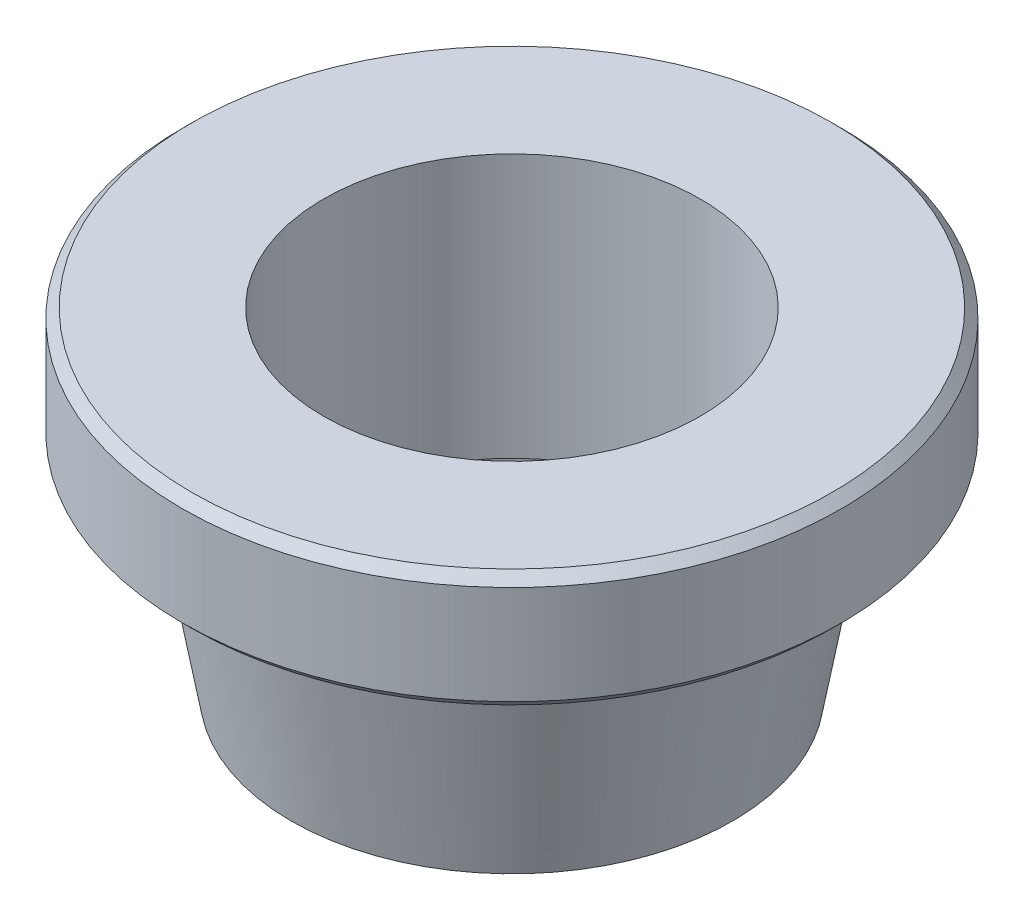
from build123d import *

# Parameters (mm, degrees)
SKICA1_R                 = 5.5
P_IDAT_VYSUNUT_M1_DEPTH  = 4.6
P_IDAT_VYSUNUT_M1_DRAFT  = -10
SKICA2_R                 = 7
P_IDAT_VYSUNUT_M2_DEPTH  = 2.5
ZKOSEN_1_SIZE            = 0.2
SKICA3_R                 = 4
ODEBRAT_VYSUNUT_M1_DEPTH = 2.5
ODEBRAT_START            = -4.6
SKICA4_R                 = 4
ODEBRAT_VYSUNUT_M2_DEPTH = 4.6
SKICA5_W                 = 0.3
SKICA5_H                 = 0.5


with BuildPart() as part:
    # Skica1 → P_idat vysunut_m1 (with draft: the straight prism first)
    with BuildSketch(Plane(origin=(0, 0, 0), x_dir=(1, 0, 0), z_dir=(0, 1, 0))):
        Circle(SKICA1_R)
    extrude(amount=-P_IDAT_VYSUNUT_M1_DEPTH)
    # P_idat vysunut_m1: the draft: its side faces are tilted about the plane it starts from
    p_idat_vysunut_m1_sides = [part.faces().sort_by_distance(p)[0] for p in [
        (-5.5, -2.3, 0),
    ]]
    draft(p_idat_vysunut_m1_sides, Plane(origin=(0, 0, 0), x_dir=(1, 0, 0), z_dir=(0, 1, 0)), P_IDAT_VYSUNUT_M1_DRAFT)

    # Skica2 → P_idat vysunut_m2 (add)
    with BuildSketch(Plane(origin=(0, 0, 0), x_dir=(-1, 0, 0), z_dir=(0, 1, 0))):
        with Locations(Location((0, 0, 0), (0, 0, 90))):
            Circle(SKICA2_R)
    extrude(amount=P_IDAT_VYSUNUT_M2_DEPTH)

    # Zkosen_1
    zkosen_1_edges = [part.edges().sort_by_distance(p)[0] for p in [
        (0, 0, -7),
        (0, 2.5, -7),
    ]]
    chamfer(zkosen_1_edges, length=ZKOSEN_1_SIZE)

    # Skica3 → Odebrat vysunut_m1 (cut)
    with BuildSketch(Plane(origin=(0, 2.5, 0), x_dir=(1, 0, 0), z_dir=(0, 1, 0))):
        with Locations(Location((0, 0, 0), (0, 0, 270))):
            Circle(SKICA3_R)
    extrude(amount=-ODEBRAT_VYSUNUT_M1_DEPTH, mode=Mode.SUBTRACT)

    # Skica4 → Odebrat vysunut_m2 (cut)
    with BuildSketch(Plane.XZ.offset(4.6).offset(ODEBRAT_START)):
        with Locations(Location((0, 0, 0), (0, 0, 90))):
            Circle(SKICA4_R)
    extrude(amount=ODEBRAT_VYSUNUT_M2_DEPTH, mode=Mode.SUBTRACT)

    # Skica5 → Odebrat rotac_1 (revolve, cut)
    with BuildSketch(Plane.XY, mode=Mode.PRIVATE) as odebrat_rotac_1_sk:
        with Locations((-4.15, -3.35)):
            Rectangle(SKICA5_W, SKICA5_H)
    revolve(odebrat_rotac_1_sk.sketch.rotate(Axis((0, 2.5, 0), (0, -1, 0)), 270), axis=Axis((0, 2.5, 0), (0, -1, 0)), mode=Mode.SUBTRACT)


solid = part.part
